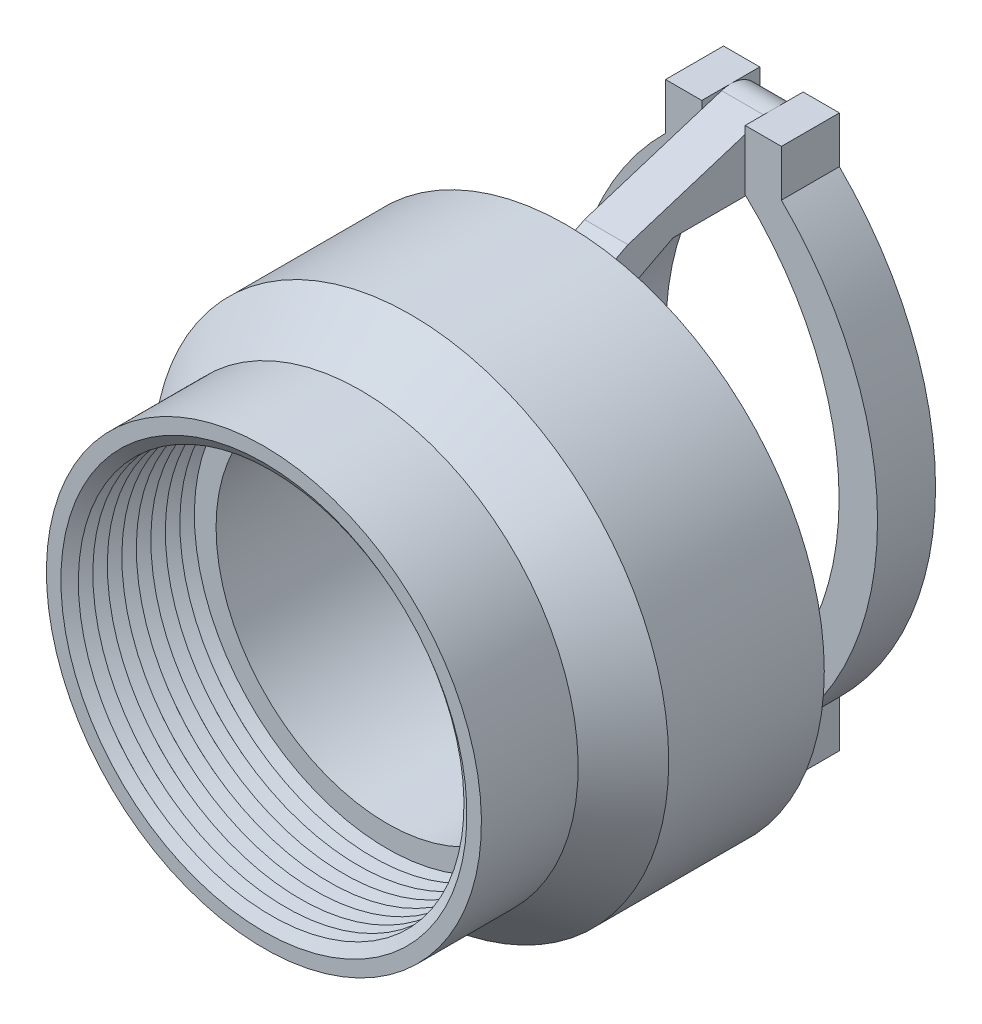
from build123d import *

# Parameters (mm, degrees)
BOSS_EXTRUDE1_DEPTH = 1.5
BOSS_EXTRUDE2_DEPTH = 2


with BuildPart() as part:
    # Sketch1 → Revolve1 (revolve)
    with BuildSketch(Plane(origin=(0, 0, 0), x_dir=(0, 0, -1), z_dir=(1, 0, 0))):
        Polygon((0, 11.8), (0, 15), (6.669988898, 15), (10.137827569, 17.78), (20.86480549, 17.78), (20.86480549, 11.8), align=None)
    revolve(axis=Axis((0, 0, 0), (0, 0, 1)))

    # Sketch4 → M28 x 1.0 _ISO (revolve, cut)
    with BuildSketch(Plane(origin=(0, 0, 0), x_dir=(0, 0, -1), z_dir=(1, 0, 0))):
        Polygon((0, 14.0005), (0.5, 13.2965), (1, 14.0005), (1.5, 13.2965), (2, 14.0005), (2.5, 13.2965), (3, 14.0005), (3.5, 13.2965), (4, 14.0005), (4.5, 13.2965), (5, 14.0005), (5.5, 13.2965), (6, 14.0005), (6.5, 13.2965), (7, 14.0005), (7.5, 13.2965), (8, 14.0005), (8.5, 13.2965), (8.5, 10.972914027), (0, 10.972914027), align=None)
    revolve(axis=Axis((0, 0, 0), (0, 0, 1)), mode=Mode.SUBTRACT)

    # Sketch2 → Boss-Extrude1 (add, symmetric)
    with BuildSketch(Plane(origin=(0, 0, 0), x_dir=(0, 0, -1), z_dir=(1, 0, 0))):
        with BuildLine():
            Line((20.86480549, 11.8), (26.714818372, 14.83219718))
            Line((26.714818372, 14.83219718), (33.69109859, 14.83219718))
            ThreePointArc((33.69109859, 14.83219718), (35.775469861, 17.261818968), (33.05711889, 18.9524501))
            Line((33.05711889, 18.9524501), (23.607717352, 15.973990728))
            Line((23.607717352, 15.973990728), (20.86480549, 14.552275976))
            Line((20.86480549, 14.552275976), (20.86480549, 11.8))
        make_face()
        with BuildLine():
            Line((20.86480549, -11.8), (26.714818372, -14.83219718))
            Line((26.714818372, -14.83219718), (33.69109859, -14.83219718))
            ThreePointArc((33.69109859, -14.83219718), (35.775469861, -17.261818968), (33.05711889, -18.9524501))
            Line((33.05711889, -18.9524501), (23.607717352, -15.973990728))
            Line((23.607717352, -15.973990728), (20.86480549, -14.552275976))
            Line((20.86480549, -14.552275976), (20.86480549, -11.8))
        make_face()
    extrude(amount=BOSS_EXTRUDE1_DEPTH, both=True)

    # Sketch3 → Boss-Extrude2 (add, symmetric)
    with BuildSketch(Plane.XY.offset(-33.69109859)):
        with BuildLine():
            Line((-1.494903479, 19.05), (-1.494903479, 14.91292631))
            ThreePointArc((-1.494903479, 14.91292631), (-7.974967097, 0), (-1.494903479, -14.91292631))
            Line((-1.494903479, -14.91292631), (-1.494903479, -19.05))
            Line((-1.494903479, -19.05), (-3.994903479, -19.05))
            Line((-3.994903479, -19.05), (-3.994903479, -15.83777694))
            ThreePointArc((-3.994903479, -15.83777694), (-10.626617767, 0), (-3.994903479, 15.83777694))
            Line((-3.994903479, 15.83777694), (-3.994903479, 19.05))
            Line((-3.994903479, 19.05), (-1.494903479, 19.05))
        make_face()
    boss_extrude2 = extrude(amount=BOSS_EXTRUDE2_DEPTH, both=True)

    # Mirror1: Boss-Extrude2 across plane
    add(boss_extrude2.mirror(Plane(origin=(0, 0, 0), x_dir=(0, 0, 1), z_dir=(1, 0, 0))))


solid = part.part
